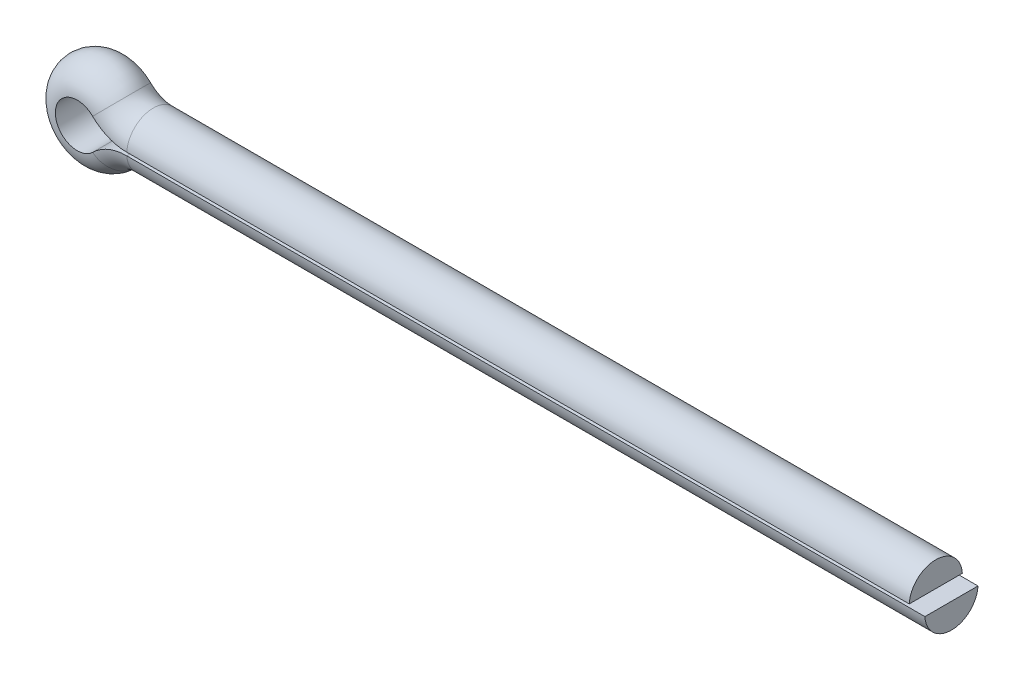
ISO-10303-21;
HEADER;
FILE_DESCRIPTION(('STEP AP214'),'2;1');
FILE_NAME('part.step','',(''),(''),'','','');
FILE_SCHEMA(('AUTOMOTIVE_DESIGN { 1 0 10303 214 1 1 1 1 }'));
ENDSEC;
DATA;
#1=APPLICATION_CONTEXT('core data for automotive mechanical design processes');
#2=APPLICATION_PROTOCOL_DEFINITION('international standard','automotive_design',2000,#1);
#3=PRODUCT_CONTEXT('',#1,'mechanical');
#4=PRODUCT('Part','Part','',(#3));
#5=PRODUCT_RELATED_PRODUCT_CATEGORY('part','',(#4));
#6=PRODUCT_DEFINITION_FORMATION('','',#4);
#7=PRODUCT_DEFINITION_CONTEXT('part definition',#1,'design');
#8=PRODUCT_DEFINITION('design','',#6,#7);
#9=PRODUCT_DEFINITION_SHAPE('','',#8);
#10=(LENGTH_UNIT() NAMED_UNIT(*) SI_UNIT(.MILLI.,.METRE.));
#11=(NAMED_UNIT(*) PLANE_ANGLE_UNIT() SI_UNIT($,.RADIAN.));
#12=(NAMED_UNIT(*) SI_UNIT($,.STERADIAN.) SOLID_ANGLE_UNIT());
#13=UNCERTAINTY_MEASURE_WITH_UNIT(LENGTH_MEASURE(1.E-05),#10,'distance_accuracy_value','');
#14=(GEOMETRIC_REPRESENTATION_CONTEXT(3) GLOBAL_UNCERTAINTY_ASSIGNED_CONTEXT((#13)) GLOBAL_UNIT_ASSIGNED_CONTEXT((#10,
#11,#12)) REPRESENTATION_CONTEXT('',''));
#15=CARTESIAN_POINT('',(0.,0.,0.));
#16=DIRECTION('',(0.,0.,1.));
#17=DIRECTION('',(1.,0.,0.));
#18=AXIS2_PLACEMENT_3D('',#15,#16,#17);
#19=CARTESIAN_POINT('',(12.954,0.,0.));
#20=DIRECTION('',(-1.,0.,0.));
#21=DIRECTION('',(0.,0.,-1.));
#22=AXIS2_PLACEMENT_3D('',#19,#20,#21);
#23=PLANE('',#22);
#24=CARTESIAN_POINT('',(12.954,0.,0.));
#25=DIRECTION('',(-1.,0.,0.));
#26=DIRECTION('',(0.,0.,-1.));
#27=AXIS2_PLACEMENT_3D('',#24,#25,#26);
#28=CIRCLE('',#27,0.4318);
#29=CARTESIAN_POINT('',(12.954,-0.0253999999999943,-0.431052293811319));
#30=VERTEX_POINT('',#29);
#31=CARTESIAN_POINT('',(12.954,-0.0253999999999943,0.431052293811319));
#32=VERTEX_POINT('',#31);
#33=EDGE_CURVE('E82',#30,#32,#28,.T.);
#34=ORIENTED_EDGE('',*,*,#33,.F.);
#35=DIRECTION('',(0.,0.,-1.));
#36=VECTOR('',#35,1.);
#37=CARTESIAN_POINT('',(12.954,-0.0253999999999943,0.431052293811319));
#38=LINE('',#37,#36);
#39=EDGE_CURVE('E87',#32,#30,#38,.T.);
#40=ORIENTED_EDGE('',*,*,#39,.F.);
#41=EDGE_LOOP('',(#34,#40));
#42=FACE_BOUND('',#41,.T.);
#43=ADVANCED_FACE('F39',(#42),#23,.F.);
#44=CARTESIAN_POINT('',(12.7,0.,0.));
#45=DIRECTION('',(1.,0.,0.));
#46=DIRECTION('',(0.,0.,-1.));
#47=AXIS2_PLACEMENT_3D('',#44,#45,#46);
#48=PLANE('',#47);
#49=CARTESIAN_POINT('',(12.7,0.,0.));
#50=DIRECTION('',(1.,0.,0.));
#51=DIRECTION('',(0.,0.,-1.));
#52=AXIS2_PLACEMENT_3D('',#49,#50,#51);
#53=CIRCLE('',#52,0.4318);
#54=CARTESIAN_POINT('',(12.7,0.0254,-0.431052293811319));
#55=VERTEX_POINT('',#54);
#56=CARTESIAN_POINT('',(12.7,0.0254,0.431052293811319));
#57=VERTEX_POINT('',#56);
#58=EDGE_CURVE('E51',#55,#57,#53,.T.);
#59=ORIENTED_EDGE('',*,*,#58,.T.);
#60=DIRECTION('',(0.,0.,-1.));
#61=VECTOR('',#60,1.);
#62=CARTESIAN_POINT('',(12.7,0.0254,0.431052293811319));
#63=LINE('',#62,#61);
#64=EDGE_CURVE('E11',#57,#55,#63,.T.);
#65=ORIENTED_EDGE('',*,*,#64,.T.);
#66=EDGE_LOOP('',(#59,#65));
#67=FACE_BOUND('',#66,.T.);
#68=ADVANCED_FACE('F187',(#67),#48,.T.);
#69=CARTESIAN_POINT('',(12.954,0.,0.));
#70=DIRECTION('',(-1.,0.,0.));
#71=DIRECTION('',(0.,-1.,0.));
#72=AXIS2_PLACEMENT_3D('',#69,#70,#71);
#73=CYLINDRICAL_SURFACE('',#72,0.4318);
#74=DIRECTION('',(-1.,0.,0.));
#75=VECTOR('',#74,1.);
#76=CARTESIAN_POINT('',(12.954,-0.0253999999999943,0.431052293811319));
#77=LINE('',#76,#75);
#78=CARTESIAN_POINT('',(0.,-0.0253999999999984,0.431052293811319));
#79=VERTEX_POINT('',#78);
#80=EDGE_CURVE('E98',#32,#79,#77,.T.);
#81=ORIENTED_EDGE('',*,*,#80,.T.);
#82=CARTESIAN_POINT('',(0.,0.,0.));
#83=DIRECTION('',(-1.,0.,0.));
#84=DIRECTION('',(0.,0.,-1.));
#85=AXIS2_PLACEMENT_3D('',#82,#83,#84);
#86=CIRCLE('',#85,0.4318);
#87=CARTESIAN_POINT('',(0.,-0.0253999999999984,-0.431052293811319));
#88=VERTEX_POINT('',#87);
#89=EDGE_CURVE('E103',#88,#79,#86,.T.);
#90=ORIENTED_EDGE('',*,*,#89,.F.);
#91=DIRECTION('',(-1.,0.,0.));
#92=VECTOR('',#91,1.);
#93=CARTESIAN_POINT('',(12.954,-0.0253999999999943,-0.431052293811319));
#94=LINE('',#93,#92);
#95=EDGE_CURVE('E100',#30,#88,#94,.T.);
#96=ORIENTED_EDGE('',*,*,#95,.F.);
#97=ORIENTED_EDGE('',*,*,#33,.T.);
#98=EDGE_LOOP('',(#81,#90,#96,#97));
#99=FACE_BOUND('',#98,.T.);
#100=ADVANCED_FACE('F101',(#99),#73,.T.);
#101=CARTESIAN_POINT('',(12.954,-0.0253999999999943,0.431052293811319));
#102=DIRECTION('',(0.,1.,0.));
#103=DIRECTION('',(-1.,0.,0.));
#104=AXIS2_PLACEMENT_3D('',#101,#102,#103);
#105=PLANE('',#104);
#106=DIRECTION('',(0.,0.,-1.));
#107=VECTOR('',#106,1.);
#108=CARTESIAN_POINT('',(0.,-0.0253999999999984,0.431052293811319));
#109=LINE('',#108,#107);
#110=EDGE_CURVE('E120',#79,#88,#109,.T.);
#111=ORIENTED_EDGE('',*,*,#110,.F.);
#112=ORIENTED_EDGE('',*,*,#80,.F.);
#113=ORIENTED_EDGE('',*,*,#39,.T.);
#114=ORIENTED_EDGE('',*,*,#95,.T.);
#115=EDGE_LOOP('',(#111,#112,#113,#114));
#116=FACE_BOUND('',#115,.T.);
#117=ADVANCED_FACE('F96',(#116),#105,.T.);
#118=CARTESIAN_POINT('',(0.,-0.8128,0.));
#119=DIRECTION('',(0.,0.,1.));
#120=DIRECTION('',(1.,0.,0.));
#121=AXIS2_PLACEMENT_3D('',#118,#119,#120);
#122=TOROIDAL_SURFACE('',#121,0.812800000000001,0.4318);
#123=CARTESIAN_POINT('',(0.,-0.8128,0.431052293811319));
#124=DIRECTION('',(0.,0.,1.));
#125=DIRECTION('',(0.,1.,0.));
#126=AXIS2_PLACEMENT_3D('',#123,#124,#125);
#127=CIRCLE('',#126,0.787400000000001);
#128=CARTESIAN_POINT('',(-0.553604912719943,-0.252871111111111,0.431052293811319));
#129=VERTEX_POINT('',#128);
#130=EDGE_CURVE('E112',#79,#129,#127,.T.);
#131=ORIENTED_EDGE('',*,*,#130,.T.);
#132=CARTESIAN_POINT('',(-0.571463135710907,-0.234808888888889,0.));
#133=DIRECTION('',(-0.711111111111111,-0.703079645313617,0.));
#134=DIRECTION('',(0.,0.,-1.));
#135=AXIS2_PLACEMENT_3D('',#132,#133,#134);
#136=CIRCLE('',#135,0.4318);
#137=CARTESIAN_POINT('',(-0.553604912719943,-0.252871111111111,-0.431052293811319));
#138=VERTEX_POINT('',#137);
#139=EDGE_CURVE('E107',#138,#129,#136,.T.);
#140=ORIENTED_EDGE('',*,*,#139,.F.);
#141=CARTESIAN_POINT('',(0.,-0.8128,-0.431052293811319));
#142=DIRECTION('',(0.,0.,1.));
#143=DIRECTION('',(0.,1.,0.));
#144=AXIS2_PLACEMENT_3D('',#141,#142,#143);
#145=CIRCLE('',#144,0.787400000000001);
#146=EDGE_CURVE('E115',#88,#138,#145,.T.);
#147=ORIENTED_EDGE('',*,*,#146,.F.);
#148=ORIENTED_EDGE('',*,*,#89,.T.);
#149=EDGE_LOOP('',(#131,#140,#147,#148));
#150=FACE_BOUND('',#149,.T.);
#151=ADVANCED_FACE('F168',(#150),#122,.T.);
#152=CARTESIAN_POINT('',(0.,-0.8128,0.));
#153=DIRECTION('',(0.,0.,1.));
#154=DIRECTION('',(1.,0.,0.));
#155=AXIS2_PLACEMENT_3D('',#152,#153,#154);
#156=CYLINDRICAL_SURFACE('',#155,0.787400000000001);
#157=DIRECTION('',(0.,0.,-1.));
#158=VECTOR('',#157,1.);
#159=CARTESIAN_POINT('',(-0.553604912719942,-0.252871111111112,0.431052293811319));
#160=LINE('',#159,#158);
#161=EDGE_CURVE('E113',#129,#138,#160,.T.);
#162=ORIENTED_EDGE('',*,*,#161,.F.);
#163=ORIENTED_EDGE('',*,*,#130,.F.);
#164=ORIENTED_EDGE('',*,*,#110,.T.);
#165=ORIENTED_EDGE('',*,*,#146,.T.);
#166=EDGE_LOOP('',(#162,#163,#164,#165));
#167=FACE_BOUND('',#166,.T.);
#168=ADVANCED_FACE('F174',(#167),#156,.T.);
#169=CARTESIAN_POINT('',(-0.803620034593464,0.,0.));
#170=DIRECTION('',(0.,0.,-1.));
#171=DIRECTION('',(-1.,0.,0.));
#172=AXIS2_PLACEMENT_3D('',#169,#170,#171);
#173=DEGENERATE_TOROIDAL_SURFACE('',#172,0.3302,0.4318,.T.);
#174=CARTESIAN_POINT('',(-0.803620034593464,0.,0.431052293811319));
#175=DIRECTION('',(0.,0.,-1.));
#176=DIRECTION('',(0.703079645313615,-0.711111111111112,0.));
#177=AXIS2_PLACEMENT_3D('',#174,#175,#176);
#178=CIRCLE('',#177,0.3556);
#179=CARTESIAN_POINT('',(-0.553604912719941,0.252871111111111,0.431052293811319));
#180=VERTEX_POINT('',#179);
#181=EDGE_CURVE('E121',#129,#180,#178,.T.);
#182=ORIENTED_EDGE('',*,*,#181,.T.);
#183=CARTESIAN_POINT('',(-0.571463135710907,0.234808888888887,0.));
#184=DIRECTION('',(0.711111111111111,-0.703079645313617,0.));
#185=DIRECTION('',(0.,0.,-1.));
#186=AXIS2_PLACEMENT_3D('',#183,#184,#185);
#187=CIRCLE('',#186,0.4318);
#188=CARTESIAN_POINT('',(-0.553604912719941,0.252871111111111,-0.431052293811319));
#189=VERTEX_POINT('',#188);
#190=EDGE_CURVE('E118',#189,#180,#187,.T.);
#191=ORIENTED_EDGE('',*,*,#190,.F.);
#192=CARTESIAN_POINT('',(-0.803620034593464,0.,-0.431052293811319));
#193=DIRECTION('',(0.,0.,-1.));
#194=DIRECTION('',(0.703079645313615,-0.711111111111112,0.));
#195=AXIS2_PLACEMENT_3D('',#192,#193,#194);
#196=CIRCLE('',#195,0.3556);
#197=EDGE_CURVE('E125',#138,#189,#196,.T.);
#198=ORIENTED_EDGE('',*,*,#197,.F.);
#199=ORIENTED_EDGE('',*,*,#139,.T.);
#200=EDGE_LOOP('',(#182,#191,#198,#199));
#201=FACE_BOUND('',#200,.T.);
#202=ADVANCED_FACE('F163',(#201),#173,.T.);
#203=CARTESIAN_POINT('',(-0.803620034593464,0.,0.));
#204=DIRECTION('',(0.,0.,-1.));
#205=DIRECTION('',(-1.,0.,0.));
#206=AXIS2_PLACEMENT_3D('',#203,#204,#205);
#207=CYLINDRICAL_SURFACE('',#206,0.3556);
#208=DIRECTION('',(0.,0.,-1.));
#209=VECTOR('',#208,1.);
#210=CARTESIAN_POINT('',(-0.553604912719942,0.25287111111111,0.431052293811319));
#211=LINE('',#210,#209);
#212=EDGE_CURVE('E127',#180,#189,#211,.T.);
#213=ORIENTED_EDGE('',*,*,#212,.F.);
#214=ORIENTED_EDGE('',*,*,#181,.F.);
#215=ORIENTED_EDGE('',*,*,#161,.T.);
#216=ORIENTED_EDGE('',*,*,#197,.T.);
#217=EDGE_LOOP('',(#213,#214,#215,#216));
#218=FACE_BOUND('',#217,.T.);
#219=ADVANCED_FACE('F164',(#218),#207,.F.);
#220=CARTESIAN_POINT('',(0.,0.8128,0.));
#221=DIRECTION('',(0.,0.,1.));
#222=DIRECTION('',(1.,0.,0.));
#223=AXIS2_PLACEMENT_3D('',#220,#221,#222);
#224=TOROIDAL_SURFACE('',#223,0.812800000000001,0.4318);
#225=CARTESIAN_POINT('',(0.,0.8128,0.431052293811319));
#226=DIRECTION('',(0.,0.,1.));
#227=DIRECTION('',(-0.703079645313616,-0.711111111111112,0.));
#228=AXIS2_PLACEMENT_3D('',#225,#226,#227);
#229=CIRCLE('',#228,0.787400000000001);
#230=CARTESIAN_POINT('',(0.,0.025399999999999,0.431052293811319));
#231=VERTEX_POINT('',#230);
#232=EDGE_CURVE('E131',#180,#231,#229,.T.);
#233=ORIENTED_EDGE('',*,*,#232,.T.);
#234=CARTESIAN_POINT('',(0.,0.,0.));
#235=DIRECTION('',(1.,0.,0.));
#236=DIRECTION('',(0.,0.,-1.));
#237=AXIS2_PLACEMENT_3D('',#234,#235,#236);
#238=CIRCLE('',#237,0.4318);
#239=CARTESIAN_POINT('',(0.,0.025399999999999,-0.431052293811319));
#240=VERTEX_POINT('',#239);
#241=EDGE_CURVE('E129',#240,#231,#238,.T.);
#242=ORIENTED_EDGE('',*,*,#241,.F.);
#243=CARTESIAN_POINT('',(0.,0.8128,-0.431052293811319));
#244=DIRECTION('',(0.,0.,1.));
#245=DIRECTION('',(-0.703079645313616,-0.711111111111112,0.));
#246=AXIS2_PLACEMENT_3D('',#243,#244,#245);
#247=CIRCLE('',#246,0.787400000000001);
#248=EDGE_CURVE('E135',#189,#240,#247,.T.);
#249=ORIENTED_EDGE('',*,*,#248,.F.);
#250=ORIENTED_EDGE('',*,*,#190,.T.);
#251=EDGE_LOOP('',(#233,#242,#249,#250));
#252=FACE_BOUND('',#251,.T.);
#253=ADVANCED_FACE('F160',(#252),#224,.T.);
#254=CARTESIAN_POINT('',(0.,0.8128,0.));
#255=DIRECTION('',(0.,0.,1.));
#256=DIRECTION('',(1.,0.,0.));
#257=AXIS2_PLACEMENT_3D('',#254,#255,#256);
#258=CYLINDRICAL_SURFACE('',#257,0.787400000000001);
#259=DIRECTION('',(0.,0.,-1.));
#260=VECTOR('',#259,1.);
#261=CARTESIAN_POINT('',(0.,0.0254000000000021,0.431052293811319));
#262=LINE('',#261,#260);
#263=EDGE_CURVE('E139',#231,#240,#262,.T.);
#264=ORIENTED_EDGE('',*,*,#263,.F.);
#265=ORIENTED_EDGE('',*,*,#232,.F.);
#266=ORIENTED_EDGE('',*,*,#212,.T.);
#267=ORIENTED_EDGE('',*,*,#248,.T.);
#268=EDGE_LOOP('',(#264,#265,#266,#267));
#269=FACE_BOUND('',#268,.T.);
#270=ADVANCED_FACE('F157',(#269),#258,.T.);
#271=CARTESIAN_POINT('',(0.,0.,0.));
#272=DIRECTION('',(1.,0.,0.));
#273=DIRECTION('',(0.,1.,0.));
#274=AXIS2_PLACEMENT_3D('',#271,#272,#273);
#275=CYLINDRICAL_SURFACE('',#274,0.4318);
#276=DIRECTION('',(1.,0.,0.));
#277=VECTOR('',#276,1.);
#278=CARTESIAN_POINT('',(0.,0.0254000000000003,0.431052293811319));
#279=LINE('',#278,#277);
#280=EDGE_CURVE('E46',#231,#57,#279,.T.);
#281=ORIENTED_EDGE('',*,*,#280,.T.);
#282=ORIENTED_EDGE('',*,*,#58,.F.);
#283=DIRECTION('',(1.,0.,0.));
#284=VECTOR('',#283,1.);
#285=CARTESIAN_POINT('',(0.,0.0254000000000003,-0.431052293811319));
#286=LINE('',#285,#284);
#287=EDGE_CURVE('E137',#240,#55,#286,.T.);
#288=ORIENTED_EDGE('',*,*,#287,.F.);
#289=ORIENTED_EDGE('',*,*,#241,.T.);
#290=EDGE_LOOP('',(#281,#282,#288,#289));
#291=FACE_BOUND('',#290,.T.);
#292=ADVANCED_FACE('F181',(#291),#275,.T.);
#293=CARTESIAN_POINT('',(0.,0.0254000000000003,0.431052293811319));
#294=DIRECTION('',(0.,-1.,0.));
#295=DIRECTION('',(1.,0.,0.));
#296=AXIS2_PLACEMENT_3D('',#293,#294,#295);
#297=PLANE('',#296);
#298=ORIENTED_EDGE('',*,*,#64,.F.);
#299=ORIENTED_EDGE('',*,*,#280,.F.);
#300=ORIENTED_EDGE('',*,*,#263,.T.);
#301=ORIENTED_EDGE('',*,*,#287,.T.);
#302=EDGE_LOOP('',(#298,#299,#300,#301));
#303=FACE_BOUND('',#302,.T.);
#304=ADVANCED_FACE('F152',(#303),#297,.T.);
#305=CLOSED_SHELL('',(#43,#68,#100,#117,#151,#168,#202,#219,#253,#270,#292,#304));
#306=MANIFOLD_SOLID_BREP('B2',#305);
#307=ADVANCED_BREP_SHAPE_REPRESENTATION('',(#18,#306),#14);
#308=SHAPE_DEFINITION_REPRESENTATION(#9,#307);
ENDSEC;
END-ISO-10303-21;
